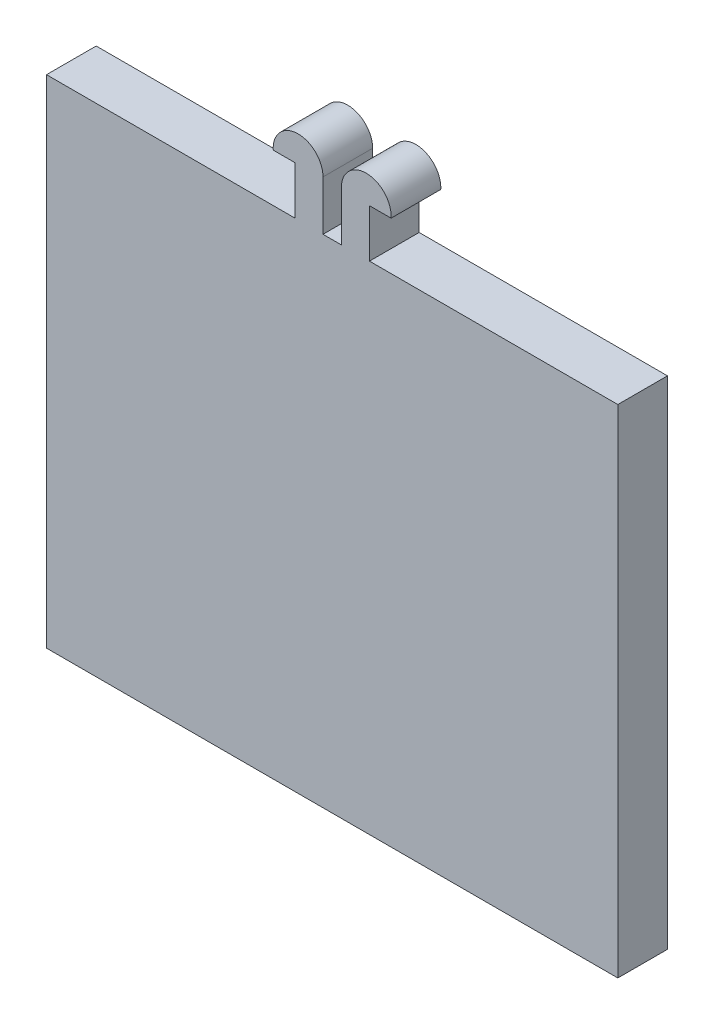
ISO-10303-21;
HEADER;
FILE_DESCRIPTION(('STEP AP214'),'2;1');
FILE_NAME('part.step','',(''),(''),'','','');
FILE_SCHEMA(('AUTOMOTIVE_DESIGN { 1 0 10303 214 1 1 1 1 }'));
ENDSEC;
DATA;
#1=APPLICATION_CONTEXT('core data for automotive mechanical design processes');
#2=APPLICATION_PROTOCOL_DEFINITION('international standard','automotive_design',2000,#1);
#3=PRODUCT_CONTEXT('',#1,'mechanical');
#4=PRODUCT('Part','Part','',(#3));
#5=PRODUCT_RELATED_PRODUCT_CATEGORY('part','',(#4));
#6=PRODUCT_DEFINITION_FORMATION('','',#4);
#7=PRODUCT_DEFINITION_CONTEXT('part definition',#1,'design');
#8=PRODUCT_DEFINITION('design','',#6,#7);
#9=PRODUCT_DEFINITION_SHAPE('','',#8);
#10=(LENGTH_UNIT() NAMED_UNIT(*) SI_UNIT(.MILLI.,.METRE.));
#11=(NAMED_UNIT(*) PLANE_ANGLE_UNIT() SI_UNIT($,.RADIAN.));
#12=(NAMED_UNIT(*) SI_UNIT($,.STERADIAN.) SOLID_ANGLE_UNIT());
#13=UNCERTAINTY_MEASURE_WITH_UNIT(LENGTH_MEASURE(1.E-05),#10,'distance_accuracy_value','');
#14=(GEOMETRIC_REPRESENTATION_CONTEXT(3) GLOBAL_UNCERTAINTY_ASSIGNED_CONTEXT((#13)) GLOBAL_UNIT_ASSIGNED_CONTEXT((#10,
#11,#12)) REPRESENTATION_CONTEXT('',''));
#15=CARTESIAN_POINT('',(0.,0.,0.));
#16=DIRECTION('',(0.,0.,1.));
#17=DIRECTION('',(1.,0.,0.));
#18=AXIS2_PLACEMENT_3D('',#15,#16,#17);
#19=CARTESIAN_POINT('',(-2.05800000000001,18.,3.));
#20=DIRECTION('',(0.,0.,-1.));
#21=DIRECTION('',(-1.,0.,0.));
#22=AXIS2_PLACEMENT_3D('',#19,#20,#21);
#23=CYLINDRICAL_SURFACE('',#22,1.504);
#24=CARTESIAN_POINT('',(-2.05800000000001,18.,0.));
#25=DIRECTION('',(0.,0.,1.));
#26=DIRECTION('',(1.,0.,0.));
#27=AXIS2_PLACEMENT_3D('',#24,#25,#26);
#28=CIRCLE('',#27,1.504);
#29=CARTESIAN_POINT('',(-3.55867184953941,17.9,0.));
#30=VERTEX_POINT('',#29);
#31=CARTESIAN_POINT('',(-0.554000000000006,18.,0.));
#32=VERTEX_POINT('',#31);
#33=EDGE_CURVE('E181',#30,#32,#28,.F.);
#34=ORIENTED_EDGE('',*,*,#33,.F.);
#35=DIRECTION('',(0.,0.,-1.));
#36=VECTOR('',#35,1.);
#37=CARTESIAN_POINT('',(-3.55867184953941,17.9,3.));
#38=LINE('',#37,#36);
#39=CARTESIAN_POINT('',(-3.55867184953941,17.9,3.));
#40=VERTEX_POINT('',#39);
#41=EDGE_CURVE('E11',#40,#30,#38,.T.);
#42=ORIENTED_EDGE('',*,*,#41,.F.);
#43=CARTESIAN_POINT('',(-2.05800000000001,18.,3.));
#44=DIRECTION('',(0.,0.,1.));
#45=DIRECTION('',(1.,0.,0.));
#46=AXIS2_PLACEMENT_3D('',#43,#44,#45);
#47=CIRCLE('',#46,1.504);
#48=CARTESIAN_POINT('',(-0.554000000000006,18.,3.));
#49=VERTEX_POINT('',#48);
#50=EDGE_CURVE('E228',#40,#49,#47,.F.);
#51=ORIENTED_EDGE('',*,*,#50,.T.);
#52=DIRECTION('',(0.,0.,-1.));
#53=VECTOR('',#52,1.);
#54=CARTESIAN_POINT('',(-0.554000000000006,18.,3.));
#55=LINE('',#54,#53);
#56=EDGE_CURVE('E115',#49,#32,#55,.T.);
#57=ORIENTED_EDGE('',*,*,#56,.T.);
#58=EDGE_LOOP('',(#34,#42,#51,#57));
#59=FACE_BOUND('',#58,.T.);
#60=ADVANCED_FACE('F46',(#59),#23,.T.);
#61=CARTESIAN_POINT('',(0.,17.9,3.));
#62=DIRECTION('',(0.,-1.,0.));
#63=DIRECTION('',(0.,0.,-1.));
#64=AXIS2_PLACEMENT_3D('',#61,#62,#63);
#65=PLANE('',#64);
#66=DIRECTION('',(-1.,0.,0.));
#67=VECTOR('',#66,1.);
#68=CARTESIAN_POINT('',(0.,17.9,0.));
#69=LINE('',#68,#67);
#70=CARTESIAN_POINT('',(-2.25400000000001,17.9,0.));
#71=VERTEX_POINT('',#70);
#72=EDGE_CURVE('E185',#71,#30,#69,.T.);
#73=ORIENTED_EDGE('',*,*,#72,.F.);
#74=DIRECTION('',(0.,0.,-1.));
#75=VECTOR('',#74,1.);
#76=CARTESIAN_POINT('',(-2.25400000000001,17.9,3.));
#77=LINE('',#76,#75);
#78=CARTESIAN_POINT('',(-2.25400000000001,17.9,3.));
#79=VERTEX_POINT('',#78);
#80=EDGE_CURVE('E55',#79,#71,#77,.T.);
#81=ORIENTED_EDGE('',*,*,#80,.F.);
#82=DIRECTION('',(-1.,0.,0.));
#83=VECTOR('',#82,1.);
#84=CARTESIAN_POINT('',(0.,17.9,3.));
#85=LINE('',#84,#83);
#86=EDGE_CURVE('E288',#79,#40,#85,.T.);
#87=ORIENTED_EDGE('',*,*,#86,.T.);
#88=ORIENTED_EDGE('',*,*,#41,.T.);
#89=EDGE_LOOP('',(#73,#81,#87,#88));
#90=FACE_BOUND('',#89,.T.);
#91=ADVANCED_FACE('F273',(#90),#65,.T.);
#92=CARTESIAN_POINT('',(-2.25400000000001,0.,3.));
#93=DIRECTION('',(-1.,0.,0.));
#94=DIRECTION('',(0.,0.,1.));
#95=AXIS2_PLACEMENT_3D('',#92,#93,#94);
#96=PLANE('',#95);
#97=DIRECTION('',(0.,1.,0.));
#98=VECTOR('',#97,1.);
#99=CARTESIAN_POINT('',(-2.25400000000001,0.,0.));
#100=LINE('',#99,#98);
#101=CARTESIAN_POINT('',(-2.25400000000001,15.,0.));
#102=VERTEX_POINT('',#101);
#103=EDGE_CURVE('E189',#102,#71,#100,.T.);
#104=ORIENTED_EDGE('',*,*,#103,.F.);
#105=DIRECTION('',(0.,0.,-1.));
#106=VECTOR('',#105,1.);
#107=CARTESIAN_POINT('',(-2.25400000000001,15.,3.));
#108=LINE('',#107,#106);
#109=CARTESIAN_POINT('',(-2.25400000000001,15.,3.));
#110=VERTEX_POINT('',#109);
#111=EDGE_CURVE('E260',#110,#102,#108,.T.);
#112=ORIENTED_EDGE('',*,*,#111,.F.);
#113=DIRECTION('',(0.,1.,0.));
#114=VECTOR('',#113,1.);
#115=CARTESIAN_POINT('',(-2.25400000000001,0.,3.));
#116=LINE('',#115,#114);
#117=EDGE_CURVE('E269',#110,#79,#116,.T.);
#118=ORIENTED_EDGE('',*,*,#117,.T.);
#119=ORIENTED_EDGE('',*,*,#80,.T.);
#120=EDGE_LOOP('',(#104,#112,#118,#119));
#121=FACE_BOUND('',#120,.T.);
#122=ADVANCED_FACE('F267',(#121),#96,.T.);
#123=CARTESIAN_POINT('',(0.,15.,3.));
#124=DIRECTION('',(0.,-1.,0.));
#125=DIRECTION('',(1.,0.,0.));
#126=AXIS2_PLACEMENT_3D('',#123,#124,#125);
#127=PLANE('',#126);
#128=DIRECTION('',(-1.,0.,0.));
#129=VECTOR('',#128,1.);
#130=CARTESIAN_POINT('',(0.,15.,0.));
#131=LINE('',#130,#129);
#132=CARTESIAN_POINT('',(-17.254,15.,0.));
#133=VERTEX_POINT('',#132);
#134=EDGE_CURVE('E193',#102,#133,#131,.T.);
#135=ORIENTED_EDGE('',*,*,#134,.T.);
#136=DIRECTION('',(0.,0.,-1.));
#137=VECTOR('',#136,1.);
#138=CARTESIAN_POINT('',(-17.254,15.,3.));
#139=LINE('',#138,#137);
#140=CARTESIAN_POINT('',(-17.254,15.,3.));
#141=VERTEX_POINT('',#140);
#142=EDGE_CURVE('E257',#141,#133,#139,.T.);
#143=ORIENTED_EDGE('',*,*,#142,.F.);
#144=DIRECTION('',(-1.,0.,0.));
#145=VECTOR('',#144,1.);
#146=CARTESIAN_POINT('',(0.,15.,3.));
#147=LINE('',#146,#145);
#148=EDGE_CURVE('E283',#110,#141,#147,.T.);
#149=ORIENTED_EDGE('',*,*,#148,.F.);
#150=ORIENTED_EDGE('',*,*,#111,.T.);
#151=EDGE_LOOP('',(#135,#143,#149,#150));
#152=FACE_BOUND('',#151,.T.);
#153=ADVANCED_FACE('F280',(#152),#127,.F.);
#154=CARTESIAN_POINT('',(-17.254,0.,3.));
#155=DIRECTION('',(-1.,0.,0.));
#156=DIRECTION('',(0.,0.,1.));
#157=AXIS2_PLACEMENT_3D('',#154,#155,#156);
#158=PLANE('',#157);
#159=DIRECTION('',(0.,1.,0.));
#160=VECTOR('',#159,1.);
#161=CARTESIAN_POINT('',(-17.254,0.,0.));
#162=LINE('',#161,#160);
#163=CARTESIAN_POINT('',(-17.254,-15.,0.));
#164=VERTEX_POINT('',#163);
#165=EDGE_CURVE('E197',#164,#133,#162,.T.);
#166=ORIENTED_EDGE('',*,*,#165,.F.);
#167=DIRECTION('',(0.,0.,-1.));
#168=VECTOR('',#167,1.);
#169=CARTESIAN_POINT('',(-17.254,-15.,3.));
#170=LINE('',#169,#168);
#171=CARTESIAN_POINT('',(-17.254,-15.,3.));
#172=VERTEX_POINT('',#171);
#173=EDGE_CURVE('E254',#172,#164,#170,.T.);
#174=ORIENTED_EDGE('',*,*,#173,.F.);
#175=DIRECTION('',(0.,1.,0.));
#176=VECTOR('',#175,1.);
#177=CARTESIAN_POINT('',(-17.254,0.,3.));
#178=LINE('',#177,#176);
#179=EDGE_CURVE('E286',#172,#141,#178,.T.);
#180=ORIENTED_EDGE('',*,*,#179,.T.);
#181=ORIENTED_EDGE('',*,*,#142,.T.);
#182=EDGE_LOOP('',(#166,#174,#180,#181));
#183=FACE_BOUND('',#182,.T.);
#184=ADVANCED_FACE('F335',(#183),#158,.T.);
#185=CARTESIAN_POINT('',(0.,-15.,3.));
#186=DIRECTION('',(0.,-1.,0.));
#187=DIRECTION('',(1.,0.,0.));
#188=AXIS2_PLACEMENT_3D('',#185,#186,#187);
#189=PLANE('',#188);
#190=DIRECTION('',(-1.,0.,0.));
#191=VECTOR('',#190,1.);
#192=CARTESIAN_POINT('',(0.,-15.,0.));
#193=LINE('',#192,#191);
#194=CARTESIAN_POINT('',(17.254,-15.,0.));
#195=VERTEX_POINT('',#194);
#196=EDGE_CURVE('E201',#195,#164,#193,.T.);
#197=ORIENTED_EDGE('',*,*,#196,.F.);
#198=DIRECTION('',(0.,0.,-1.));
#199=VECTOR('',#198,1.);
#200=CARTESIAN_POINT('',(17.254,-15.,3.));
#201=LINE('',#200,#199);
#202=CARTESIAN_POINT('',(17.254,-15.,3.));
#203=VERTEX_POINT('',#202);
#204=EDGE_CURVE('E251',#203,#195,#201,.T.);
#205=ORIENTED_EDGE('',*,*,#204,.F.);
#206=DIRECTION('',(-1.,0.,0.));
#207=VECTOR('',#206,1.);
#208=CARTESIAN_POINT('',(0.,-15.,3.));
#209=LINE('',#208,#207);
#210=EDGE_CURVE('E297',#203,#172,#209,.T.);
#211=ORIENTED_EDGE('',*,*,#210,.T.);
#212=ORIENTED_EDGE('',*,*,#173,.T.);
#213=EDGE_LOOP('',(#197,#205,#211,#212));
#214=FACE_BOUND('',#213,.T.);
#215=ADVANCED_FACE('F338',(#214),#189,.T.);
#216=CARTESIAN_POINT('',(17.254,0.,3.));
#217=DIRECTION('',(-1.,0.,0.));
#218=DIRECTION('',(0.,-1.,0.));
#219=AXIS2_PLACEMENT_3D('',#216,#217,#218);
#220=PLANE('',#219);
#221=DIRECTION('',(0.,1.,0.));
#222=VECTOR('',#221,1.);
#223=CARTESIAN_POINT('',(17.254,0.,0.));
#224=LINE('',#223,#222);
#225=CARTESIAN_POINT('',(17.254,15.,0.));
#226=VERTEX_POINT('',#225);
#227=EDGE_CURVE('E205',#195,#226,#224,.T.);
#228=ORIENTED_EDGE('',*,*,#227,.T.);
#229=DIRECTION('',(0.,0.,-1.));
#230=VECTOR('',#229,1.);
#231=CARTESIAN_POINT('',(17.254,15.,3.));
#232=LINE('',#231,#230);
#233=CARTESIAN_POINT('',(17.254,15.,3.));
#234=VERTEX_POINT('',#233);
#235=EDGE_CURVE('E247',#234,#226,#232,.T.);
#236=ORIENTED_EDGE('',*,*,#235,.F.);
#237=DIRECTION('',(0.,1.,0.));
#238=VECTOR('',#237,1.);
#239=CARTESIAN_POINT('',(17.254,0.,3.));
#240=LINE('',#239,#238);
#241=EDGE_CURVE('E301',#203,#234,#240,.T.);
#242=ORIENTED_EDGE('',*,*,#241,.F.);
#243=ORIENTED_EDGE('',*,*,#204,.T.);
#244=EDGE_LOOP('',(#228,#236,#242,#243));
#245=FACE_BOUND('',#244,.T.);
#246=ADVANCED_FACE('F342',(#245),#220,.F.);
#247=CARTESIAN_POINT('',(0.,15.,3.));
#248=DIRECTION('',(0.,-1.,0.));
#249=DIRECTION('',(0.,0.,-1.));
#250=AXIS2_PLACEMENT_3D('',#247,#248,#249);
#251=PLANE('',#250);
#252=DIRECTION('',(-1.,0.,0.));
#253=VECTOR('',#252,1.);
#254=CARTESIAN_POINT('',(0.,15.,0.));
#255=LINE('',#254,#253);
#256=CARTESIAN_POINT('',(2.254,15.,0.));
#257=VERTEX_POINT('',#256);
#258=EDGE_CURVE('E208',#226,#257,#255,.T.);
#259=ORIENTED_EDGE('',*,*,#258,.T.);
#260=DIRECTION('',(0.,0.,-1.));
#261=VECTOR('',#260,1.);
#262=CARTESIAN_POINT('',(2.254,15.,3.));
#263=LINE('',#262,#261);
#264=CARTESIAN_POINT('',(2.254,15.,3.));
#265=VERTEX_POINT('',#264);
#266=EDGE_CURVE('E243',#265,#257,#263,.T.);
#267=ORIENTED_EDGE('',*,*,#266,.F.);
#268=DIRECTION('',(-1.,0.,0.));
#269=VECTOR('',#268,1.);
#270=CARTESIAN_POINT('',(0.,15.,3.));
#271=LINE('',#270,#269);
#272=EDGE_CURVE('E304',#234,#265,#271,.T.);
#273=ORIENTED_EDGE('',*,*,#272,.F.);
#274=ORIENTED_EDGE('',*,*,#235,.T.);
#275=EDGE_LOOP('',(#259,#267,#273,#274));
#276=FACE_BOUND('',#275,.T.);
#277=ADVANCED_FACE('F346',(#276),#251,.F.);
#278=CARTESIAN_POINT('',(2.254,0.,3.));
#279=DIRECTION('',(-1.,0.,0.));
#280=DIRECTION('',(0.,0.,1.));
#281=AXIS2_PLACEMENT_3D('',#278,#279,#280);
#282=PLANE('',#281);
#283=DIRECTION('',(0.,1.,0.));
#284=VECTOR('',#283,1.);
#285=CARTESIAN_POINT('',(2.254,0.,0.));
#286=LINE('',#285,#284);
#287=CARTESIAN_POINT('',(2.254,17.9,0.));
#288=VERTEX_POINT('',#287);
#289=EDGE_CURVE('E211',#257,#288,#286,.T.);
#290=ORIENTED_EDGE('',*,*,#289,.T.);
#291=DIRECTION('',(0.,0.,-1.));
#292=VECTOR('',#291,1.);
#293=CARTESIAN_POINT('',(2.254,17.9,3.));
#294=LINE('',#293,#292);
#295=CARTESIAN_POINT('',(2.254,17.9,3.));
#296=VERTEX_POINT('',#295);
#297=EDGE_CURVE('E239',#296,#288,#294,.T.);
#298=ORIENTED_EDGE('',*,*,#297,.F.);
#299=DIRECTION('',(0.,1.,0.));
#300=VECTOR('',#299,1.);
#301=CARTESIAN_POINT('',(2.254,0.,3.));
#302=LINE('',#301,#300);
#303=EDGE_CURVE('E307',#265,#296,#302,.T.);
#304=ORIENTED_EDGE('',*,*,#303,.F.);
#305=ORIENTED_EDGE('',*,*,#266,.T.);
#306=EDGE_LOOP('',(#290,#298,#304,#305));
#307=FACE_BOUND('',#306,.T.);
#308=ADVANCED_FACE('F350',(#307),#282,.F.);
#309=CARTESIAN_POINT('',(0.,17.9,3.));
#310=DIRECTION('',(0.,1.,0.));
#311=DIRECTION('',(0.,0.,1.));
#312=AXIS2_PLACEMENT_3D('',#309,#310,#311);
#313=PLANE('',#312);
#314=DIRECTION('',(1.,0.,0.));
#315=VECTOR('',#314,1.);
#316=CARTESIAN_POINT('',(0.,17.9,0.));
#317=LINE('',#316,#315);
#318=CARTESIAN_POINT('',(3.55867184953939,17.9,0.));
#319=VERTEX_POINT('',#318);
#320=EDGE_CURVE('E214',#288,#319,#317,.T.);
#321=ORIENTED_EDGE('',*,*,#320,.T.);
#322=DIRECTION('',(0.,0.,-1.));
#323=VECTOR('',#322,1.);
#324=CARTESIAN_POINT('',(3.55867184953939,17.9,3.));
#325=LINE('',#324,#323);
#326=CARTESIAN_POINT('',(3.55867184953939,17.9,3.));
#327=VERTEX_POINT('',#326);
#328=EDGE_CURVE('E235',#327,#319,#325,.T.);
#329=ORIENTED_EDGE('',*,*,#328,.F.);
#330=DIRECTION('',(1.,0.,0.));
#331=VECTOR('',#330,1.);
#332=CARTESIAN_POINT('',(0.,17.9,3.));
#333=LINE('',#332,#331);
#334=EDGE_CURVE('E175',#296,#327,#333,.T.);
#335=ORIENTED_EDGE('',*,*,#334,.F.);
#336=ORIENTED_EDGE('',*,*,#297,.T.);
#337=EDGE_LOOP('',(#321,#329,#335,#336));
#338=FACE_BOUND('',#337,.T.);
#339=ADVANCED_FACE('F315',(#338),#313,.F.);
#340=CARTESIAN_POINT('',(2.05799999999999,18.,3.));
#341=DIRECTION('',(0.,0.,-1.));
#342=DIRECTION('',(-1.,0.,0.));
#343=AXIS2_PLACEMENT_3D('',#340,#341,#342);
#344=CYLINDRICAL_SURFACE('',#343,1.504);
#345=CARTESIAN_POINT('',(2.05799999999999,18.,0.));
#346=DIRECTION('',(0.,0.,1.));
#347=DIRECTION('',(1.,0.,0.));
#348=AXIS2_PLACEMENT_3D('',#345,#346,#347);
#349=CIRCLE('',#348,1.504);
#350=CARTESIAN_POINT('',(0.553999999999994,18.,0.));
#351=VERTEX_POINT('',#350);
#352=EDGE_CURVE('E217',#319,#351,#349,.T.);
#353=ORIENTED_EDGE('',*,*,#352,.T.);
#354=DIRECTION('',(0.,0.,-1.));
#355=VECTOR('',#354,1.);
#356=CARTESIAN_POINT('',(0.553999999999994,18.,3.));
#357=LINE('',#356,#355);
#358=CARTESIAN_POINT('',(0.553999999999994,18.,3.));
#359=VERTEX_POINT('',#358);
#360=EDGE_CURVE('E161',#359,#351,#357,.T.);
#361=ORIENTED_EDGE('',*,*,#360,.F.);
#362=CARTESIAN_POINT('',(2.05799999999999,18.,3.));
#363=DIRECTION('',(0.,0.,1.));
#364=DIRECTION('',(1.,0.,0.));
#365=AXIS2_PLACEMENT_3D('',#362,#363,#364);
#366=CIRCLE('',#365,1.504);
#367=EDGE_CURVE('E170',#327,#359,#366,.T.);
#368=ORIENTED_EDGE('',*,*,#367,.F.);
#369=ORIENTED_EDGE('',*,*,#328,.T.);
#370=EDGE_LOOP('',(#353,#361,#368,#369));
#371=FACE_BOUND('',#370,.T.);
#372=ADVANCED_FACE('F319',(#371),#344,.T.);
#373=CARTESIAN_POINT('',(0.553999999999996,0.,3.));
#374=DIRECTION('',(-1.,0.,0.));
#375=DIRECTION('',(0.,-1.,0.));
#376=AXIS2_PLACEMENT_3D('',#373,#374,#375);
#377=PLANE('',#376);
#378=DIRECTION('',(0.,1.,0.));
#379=VECTOR('',#378,1.);
#380=CARTESIAN_POINT('',(0.553999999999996,0.,0.));
#381=LINE('',#380,#379);
#382=CARTESIAN_POINT('',(0.553999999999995,15.,0.));
#383=VERTEX_POINT('',#382);
#384=EDGE_CURVE('E159',#383,#351,#381,.T.);
#385=ORIENTED_EDGE('',*,*,#384,.F.);
#386=DIRECTION('',(0.,0.,-1.));
#387=VECTOR('',#386,1.);
#388=CARTESIAN_POINT('',(0.553999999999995,15.,3.));
#389=LINE('',#388,#387);
#390=CARTESIAN_POINT('',(0.553999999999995,15.,3.));
#391=VERTEX_POINT('',#390);
#392=EDGE_CURVE('E153',#391,#383,#389,.T.);
#393=ORIENTED_EDGE('',*,*,#392,.F.);
#394=DIRECTION('',(0.,1.,0.));
#395=VECTOR('',#394,1.);
#396=CARTESIAN_POINT('',(0.553999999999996,0.,3.));
#397=LINE('',#396,#395);
#398=EDGE_CURVE('E157',#391,#359,#397,.T.);
#399=ORIENTED_EDGE('',*,*,#398,.T.);
#400=ORIENTED_EDGE('',*,*,#360,.T.);
#401=EDGE_LOOP('',(#385,#393,#399,#400));
#402=FACE_BOUND('',#401,.T.);
#403=ADVANCED_FACE('F155',(#402),#377,.T.);
#404=CARTESIAN_POINT('',(0.,15.,3.));
#405=DIRECTION('',(0.,-1.,0.));
#406=DIRECTION('',(0.,0.,-1.));
#407=AXIS2_PLACEMENT_3D('',#404,#405,#406);
#408=PLANE('',#407);
#409=DIRECTION('',(-1.,0.,0.));
#410=VECTOR('',#409,1.);
#411=CARTESIAN_POINT('',(0.,15.,0.));
#412=LINE('',#411,#410);
#413=CARTESIAN_POINT('',(-0.554000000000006,15.,0.));
#414=VERTEX_POINT('',#413);
#415=EDGE_CURVE('E108',#383,#414,#412,.T.);
#416=ORIENTED_EDGE('',*,*,#415,.T.);
#417=DIRECTION('',(0.,0.,-1.));
#418=VECTOR('',#417,1.);
#419=CARTESIAN_POINT('',(-0.554000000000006,15.,3.));
#420=LINE('',#419,#418);
#421=CARTESIAN_POINT('',(-0.554000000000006,15.,3.));
#422=VERTEX_POINT('',#421);
#423=EDGE_CURVE('E162',#422,#414,#420,.T.);
#424=ORIENTED_EDGE('',*,*,#423,.F.);
#425=DIRECTION('',(-1.,0.,0.));
#426=VECTOR('',#425,1.);
#427=CARTESIAN_POINT('',(0.,15.,3.));
#428=LINE('',#427,#426);
#429=EDGE_CURVE('E164',#391,#422,#428,.T.);
#430=ORIENTED_EDGE('',*,*,#429,.F.);
#431=ORIENTED_EDGE('',*,*,#392,.T.);
#432=EDGE_LOOP('',(#416,#424,#430,#431));
#433=FACE_BOUND('',#432,.T.);
#434=ADVANCED_FACE('F165',(#433),#408,.F.);
#435=CARTESIAN_POINT('',(-0.554000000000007,0.,3.));
#436=DIRECTION('',(-1.,0.,0.));
#437=DIRECTION('',(0.,-1.,0.));
#438=AXIS2_PLACEMENT_3D('',#435,#436,#437);
#439=PLANE('',#438);
#440=DIRECTION('',(0.,1.,0.));
#441=VECTOR('',#440,1.);
#442=CARTESIAN_POINT('',(-0.554000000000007,0.,0.));
#443=LINE('',#442,#441);
#444=EDGE_CURVE('E225',#414,#32,#443,.T.);
#445=ORIENTED_EDGE('',*,*,#444,.T.);
#446=ORIENTED_EDGE('',*,*,#56,.F.);
#447=DIRECTION('',(0.,1.,0.));
#448=VECTOR('',#447,1.);
#449=CARTESIAN_POINT('',(-0.554000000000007,0.,3.));
#450=LINE('',#449,#448);
#451=EDGE_CURVE('E63',#422,#49,#450,.T.);
#452=ORIENTED_EDGE('',*,*,#451,.F.);
#453=ORIENTED_EDGE('',*,*,#423,.T.);
#454=EDGE_LOOP('',(#445,#446,#452,#453));
#455=FACE_BOUND('',#454,.T.);
#456=ADVANCED_FACE('F322',(#455),#439,.F.);
#457=CARTESIAN_POINT('',(0.,0.,3.));
#458=DIRECTION('',(0.,0.,1.));
#459=DIRECTION('',(1.,0.,0.));
#460=AXIS2_PLACEMENT_3D('',#457,#458,#459);
#461=PLANE('',#460);
#462=ORIENTED_EDGE('',*,*,#50,.F.);
#463=ORIENTED_EDGE('',*,*,#86,.F.);
#464=ORIENTED_EDGE('',*,*,#117,.F.);
#465=ORIENTED_EDGE('',*,*,#148,.T.);
#466=ORIENTED_EDGE('',*,*,#179,.F.);
#467=ORIENTED_EDGE('',*,*,#210,.F.);
#468=ORIENTED_EDGE('',*,*,#241,.T.);
#469=ORIENTED_EDGE('',*,*,#272,.T.);
#470=ORIENTED_EDGE('',*,*,#303,.T.);
#471=ORIENTED_EDGE('',*,*,#334,.T.);
#472=ORIENTED_EDGE('',*,*,#367,.T.);
#473=ORIENTED_EDGE('',*,*,#398,.F.);
#474=ORIENTED_EDGE('',*,*,#429,.T.);
#475=ORIENTED_EDGE('',*,*,#451,.T.);
#476=EDGE_LOOP('',(#462,#463,#464,#465,#466,#467,#468,#469,#470,#471,#472,#473,#474,#475));
#477=FACE_BOUND('',#476,.T.);
#478=ADVANCED_FACE('F168',(#477),#461,.T.);
#479=CARTESIAN_POINT('',(0.,0.,0.));
#480=DIRECTION('',(0.,0.,1.));
#481=DIRECTION('',(1.,0.,0.));
#482=AXIS2_PLACEMENT_3D('',#479,#480,#481);
#483=PLANE('',#482);
#484=ORIENTED_EDGE('',*,*,#33,.T.);
#485=ORIENTED_EDGE('',*,*,#444,.F.);
#486=ORIENTED_EDGE('',*,*,#415,.F.);
#487=ORIENTED_EDGE('',*,*,#384,.T.);
#488=ORIENTED_EDGE('',*,*,#352,.F.);
#489=ORIENTED_EDGE('',*,*,#320,.F.);
#490=ORIENTED_EDGE('',*,*,#289,.F.);
#491=ORIENTED_EDGE('',*,*,#258,.F.);
#492=ORIENTED_EDGE('',*,*,#227,.F.);
#493=ORIENTED_EDGE('',*,*,#196,.T.);
#494=ORIENTED_EDGE('',*,*,#165,.T.);
#495=ORIENTED_EDGE('',*,*,#134,.F.);
#496=ORIENTED_EDGE('',*,*,#103,.T.);
#497=ORIENTED_EDGE('',*,*,#72,.T.);
#498=EDGE_LOOP('',(#484,#485,#486,#487,#488,#489,#490,#491,#492,#493,#494,#495,#496,#497));
#499=FACE_BOUND('',#498,.T.);
#500=ADVANCED_FACE('F276',(#499),#483,.F.);
#501=CLOSED_SHELL('',(#60,#91,#122,#153,#184,#215,#246,#277,#308,#339,#372,#403,#434,#456,#478,#500));
#502=MANIFOLD_SOLID_BREP('B2',#501);
#503=ADVANCED_BREP_SHAPE_REPRESENTATION('',(#18,#502),#14);
#504=SHAPE_DEFINITION_REPRESENTATION(#9,#503);
ENDSEC;
END-ISO-10303-21;
